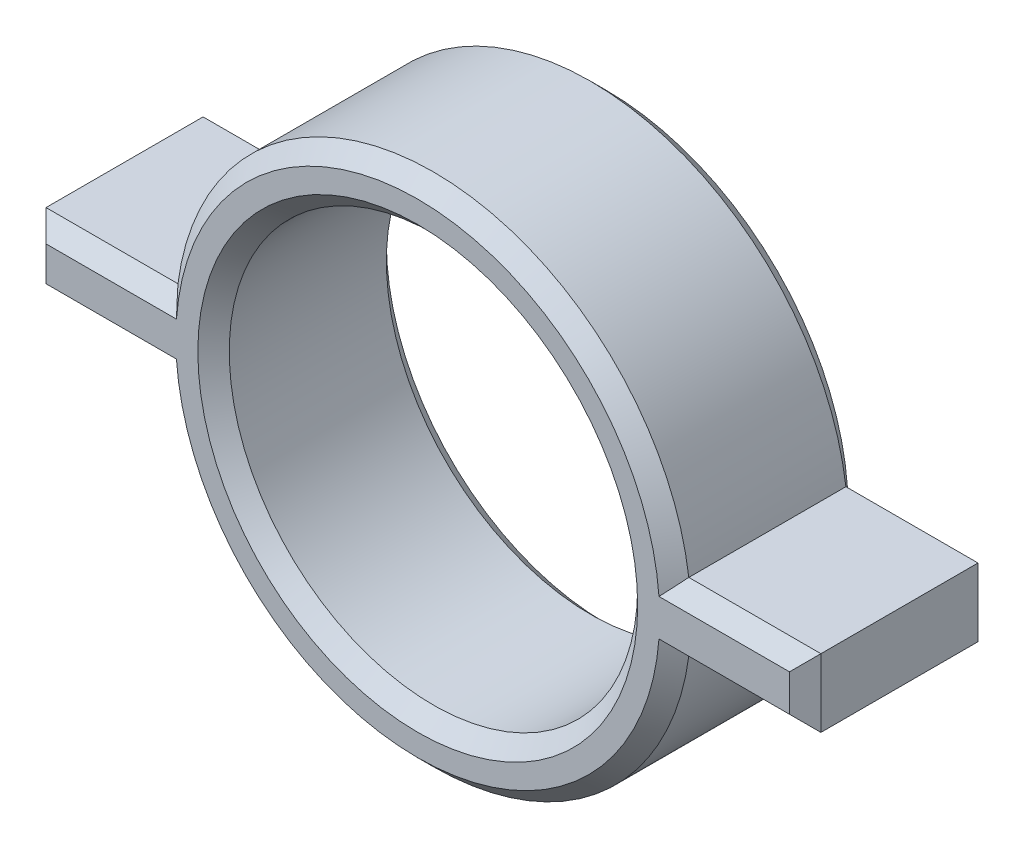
from build123d import *

# Parameters (mm, degrees)
SKETCH1_R           = 6.5
BOSS_EXTRUDE1_DEPTH = 6
CHAMFER1_SIZE       = 0.5


with BuildPart() as part:
    # Sketch1 → Boss-Extrude1 (new body)
    with BuildSketch(Plane.XY):
        with BuildLine():
            Line((8.127861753, -1.085294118), (12.332496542, -1.085294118))
            Line((12.332496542, -1.085294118), (12.332496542, 1.085294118))
            Line((12.332496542, 1.085294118), (8.127861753, 1.085294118))
            ThreePointArc((8.127861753, 1.085294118), (-0.017798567, 8.199980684), (-8.132496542, 1.05))
            Line((-8.132496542, 1.05), (-12.332496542, 1.05))
            Line((-12.332496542, 1.05), (-12.332496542, -1.05))
            Line((-12.332496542, -1.05), (-8.132496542, -1.05))
            ThreePointArc((-8.132496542, -1.05), (-0.017798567, -8.199980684), (8.127861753, -1.085294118))
        make_face()
        Circle(SKETCH1_R, mode=Mode.SUBTRACT)
    extrude(amount=BOSS_EXTRUDE1_DEPTH)

    # Chamfer1
    chamfer1_edges = [part.edges().sort_by_distance(p)[0] for p in [
        (-0.017798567, -8.199980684, 0),
        (-10.232496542, -1.05, 0),
        (-12.332496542, 0, 0),
        (-10.232496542, 1.05, 0),
        (-10.232496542, -1.05, 6),
        (-0.017798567, -8.199980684, 6),
        (10.230179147, -1.085294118, 6),
        (-6.5, 0, 0),
        (-6.5, 0, 6),
        (12.332496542, 0, 6),
        (10.230179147, 1.085294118, 6),
        (-0.017798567, 8.199980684, 6),
        (-10.232496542, 1.05, 6),
        (-0.017798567, 8.199980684, 0),
        (-12.332496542, 0, 6),
        (10.230179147, 1.085294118, 0),
        (12.332496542, 0, 0),
        (10.230179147, -1.085294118, 0),
    ]]
    chamfer(chamfer1_edges, length=CHAMFER1_SIZE)


solid = part.part
